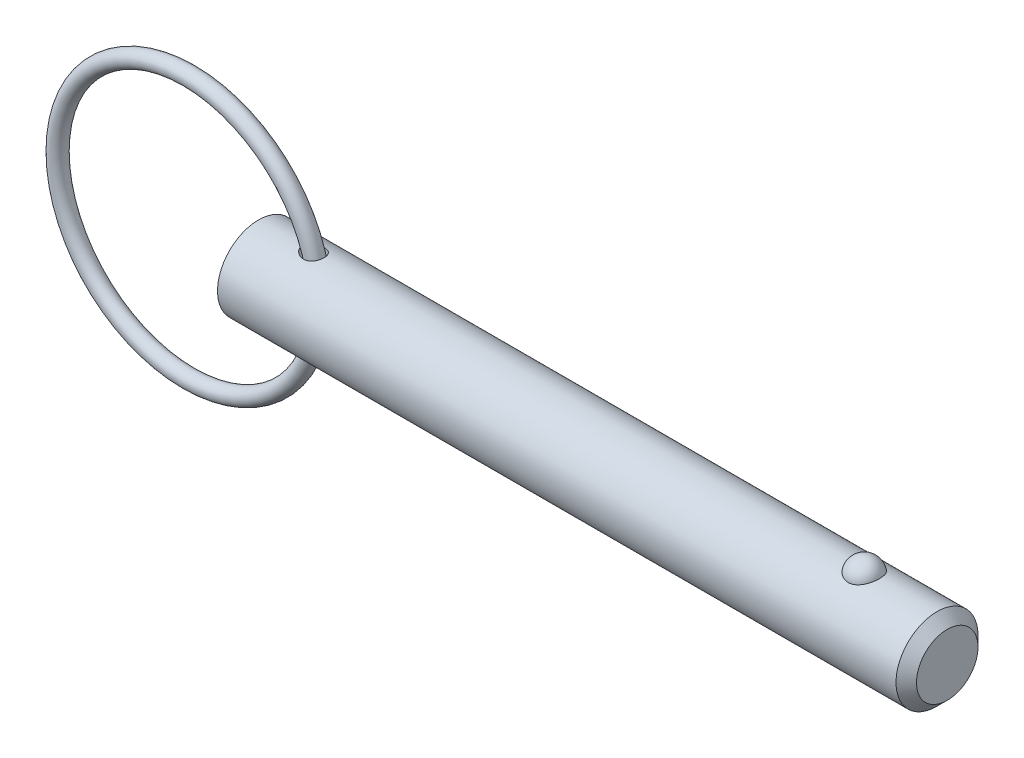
ISO-10303-21;
HEADER;
FILE_DESCRIPTION(('STEP AP214'),'2;1');
FILE_NAME('part.step','',(''),(''),'','','');
FILE_SCHEMA(('AUTOMOTIVE_DESIGN { 1 0 10303 214 1 1 1 1 }'));
ENDSEC;
DATA;
#1=APPLICATION_CONTEXT('core data for automotive mechanical design processes');
#2=APPLICATION_PROTOCOL_DEFINITION('international standard','automotive_design',2000,#1);
#3=PRODUCT_CONTEXT('',#1,'mechanical');
#4=PRODUCT('Part','Part','',(#3));
#5=PRODUCT_RELATED_PRODUCT_CATEGORY('part','',(#4));
#6=PRODUCT_DEFINITION_FORMATION('','',#4);
#7=PRODUCT_DEFINITION_CONTEXT('part definition',#1,'design');
#8=PRODUCT_DEFINITION('design','',#6,#7);
#9=PRODUCT_DEFINITION_SHAPE('','',#8);
#10=(LENGTH_UNIT() NAMED_UNIT(*) SI_UNIT(.MILLI.,.METRE.));
#11=(NAMED_UNIT(*) PLANE_ANGLE_UNIT() SI_UNIT($,.RADIAN.));
#12=(NAMED_UNIT(*) SI_UNIT($,.STERADIAN.) SOLID_ANGLE_UNIT());
#13=UNCERTAINTY_MEASURE_WITH_UNIT(LENGTH_MEASURE(1.E-05),#10,'distance_accuracy_value','');
#14=(GEOMETRIC_REPRESENTATION_CONTEXT(3) GLOBAL_UNCERTAINTY_ASSIGNED_CONTEXT((#13)) GLOBAL_UNIT_ASSIGNED_CONTEXT((#10,
#11,#12)) REPRESENTATION_CONTEXT('',''));
#15=CARTESIAN_POINT('',(0.,0.,0.));
#16=DIRECTION('',(0.,0.,1.));
#17=DIRECTION('',(1.,0.,0.));
#18=AXIS2_PLACEMENT_3D('',#15,#16,#17);
#19=CARTESIAN_POINT('',(-6.75433730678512,0.,0.));
#20=DIRECTION('',(0.,0.,1.));
#21=DIRECTION('',(1.,0.,0.));
#22=AXIS2_PLACEMENT_3D('',#19,#20,#21);
#23=TOROIDAL_SURFACE('',#22,12.7,0.794);
#24=CARTESIAN_POINT('',(6.73966269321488,0.,0.));
#25=VERTEX_POINT('',#24);
#26=VERTEX_LOOP('',#25);
#27=FACE_BOUND('',#26,.T.);
#28=ADVANCED_FACE('P0_F12',(#27),#23,.T.);
#29=CLOSED_SHELL('',(#28));
#30=MANIFOLD_SOLID_BREP('P0_B1',#29);
#31=CARTESIAN_POINT('',(0.,0.,0.));
#32=DIRECTION('',(1.,0.,0.));
#33=DIRECTION('',(0.,0.,-1.));
#34=AXIS2_PLACEMENT_3D('',#31,#32,#33);
#35=CYLINDRICAL_SURFACE('',#34,3.97);
#36=CARTESIAN_POINT('',(4.5061340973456,3.92152479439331,-0.618499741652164));
#37=CARTESIAN_POINT('',(4.54853517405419,3.91408351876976,-0.665679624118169));
#38=CARTESIAN_POINT('',(4.59520918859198,3.90637054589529,-0.709047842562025));
#39=CARTESIAN_POINT('',(4.69529850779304,3.89134328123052,-0.787367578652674));
#40=CARTESIAN_POINT('',(4.74872860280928,3.88402991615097,-0.822300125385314));
#41=CARTESIAN_POINT('',(4.86059505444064,3.87069188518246,-0.882953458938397));
#42=CARTESIAN_POINT('',(4.91902090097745,3.86466460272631,-0.908693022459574));
#43=CARTESIAN_POINT('',(5.03942053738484,3.85463812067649,-0.950329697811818));
#44=CARTESIAN_POINT('',(5.10139227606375,3.85063776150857,-0.966232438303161));
#45=CARTESIAN_POINT('',(5.22799334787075,3.84521819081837,-0.987584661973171));
#46=CARTESIAN_POINT('',(5.29264515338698,3.84382942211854,-0.992910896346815));
#47=CARTESIAN_POINT('',(5.42187784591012,3.84405510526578,-0.992040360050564));
#48=CARTESIAN_POINT('',(5.48645875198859,3.84566813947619,-0.985849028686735));
#49=CARTESIAN_POINT('',(5.60832575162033,3.85155853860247,-0.96256141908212));
#50=CARTESIAN_POINT('',(5.66579014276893,3.85562063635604,-0.946343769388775));
#51=CARTESIAN_POINT('',(5.77675338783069,3.86576598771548,-0.904004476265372));
#52=CARTESIAN_POINT('',(5.83025379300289,3.87184844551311,-0.877886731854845));
#53=CARTESIAN_POINT('',(5.92811265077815,3.88482601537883,-0.818464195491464));
#54=CARTESIAN_POINT('',(5.97284196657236,3.89164057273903,-0.785750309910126));
#55=CARTESIAN_POINT('',(6.05599619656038,3.90559314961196,-0.713164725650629));
#56=CARTESIAN_POINT('',(6.09442162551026,3.91273114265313,-0.673293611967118));
#57=CARTESIAN_POINT('',(6.16349552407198,3.92643411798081,-0.588089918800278));
#58=CARTESIAN_POINT('',(6.19423746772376,3.93300527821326,-0.542833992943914));
#59=CARTESIAN_POINT('',(6.24784048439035,3.94496273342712,-0.447731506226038));
#60=CARTESIAN_POINT('',(6.27070130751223,3.95034899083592,-0.3978847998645));
#61=CARTESIAN_POINT('',(6.30819009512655,3.95940331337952,-0.294515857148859));
#62=CARTESIAN_POINT('',(6.32274046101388,3.96305513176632,-0.240964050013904));
#63=CARTESIAN_POINT('',(6.34295490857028,3.96817541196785,-0.132107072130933));
#64=CARTESIAN_POINT('',(6.34861870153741,3.96964380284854,-0.0768018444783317));
#65=CARTESIAN_POINT('',(6.35094049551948,3.97024250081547,0.0343098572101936));
#66=CARTESIAN_POINT('',(6.34754972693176,3.96936014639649,0.0901174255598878));
#67=CARTESIAN_POINT('',(6.33173352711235,3.9653248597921,0.200354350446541));
#68=CARTESIAN_POINT('',(6.31930791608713,3.96217188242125,0.254783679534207));
#69=CARTESIAN_POINT('',(6.28569545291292,3.95393415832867,0.360736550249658));
#70=CARTESIAN_POINT('',(6.26450524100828,3.94884867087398,0.412258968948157));
#71=CARTESIAN_POINT('',(6.21385621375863,3.93730247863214,0.510898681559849));
#72=CARTESIAN_POINT('',(6.1843975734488,3.93084180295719,0.558016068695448));
#73=CARTESIAN_POINT('',(6.11807283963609,3.91729312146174,0.646300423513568));
#74=CARTESIAN_POINT('',(6.08123803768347,3.91020783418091,0.687491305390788));
#75=CARTESIAN_POINT('',(6.00105036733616,3.89618447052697,0.762970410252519));
#76=CARTESIAN_POINT('',(5.95769831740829,3.88924637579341,0.797259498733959));
#77=CARTESIAN_POINT('',(5.86613530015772,3.87636375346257,0.857702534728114));
#78=CARTESIAN_POINT('',(5.81797537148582,3.87041026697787,0.883931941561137));
#79=CARTESIAN_POINT('',(5.71784316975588,3.86006042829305,0.928089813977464));
#80=CARTESIAN_POINT('',(5.66587104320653,3.85566401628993,0.946018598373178));
#81=CARTESIAN_POINT('',(5.55935910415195,3.84884784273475,0.973381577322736));
#82=CARTESIAN_POINT('',(5.5048082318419,3.84643760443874,0.982774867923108));
#83=CARTESIAN_POINT('',(5.39486598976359,3.84381055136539,0.992999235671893));
#84=CARTESIAN_POINT('',(5.33947443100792,3.84359423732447,0.993828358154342));
#85=CARTESIAN_POINT('',(5.22648231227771,3.84533176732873,0.987084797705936));
#86=CARTESIAN_POINT('',(5.16890896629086,3.84739412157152,0.979092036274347));
#87=CARTESIAN_POINT('',(5.05572652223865,3.85355237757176,0.954563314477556));
#88=CARTESIAN_POINT('',(5.00011821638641,3.85764908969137,0.938023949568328));
#89=CARTESIAN_POINT('',(4.88760177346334,3.86780726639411,0.895259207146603));
#90=CARTESIAN_POINT('',(4.83096658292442,3.87400321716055,0.868345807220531));
#91=CARTESIAN_POINT('',(4.72283286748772,3.88749324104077,0.805802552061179));
#92=CARTESIAN_POINT('',(4.67133743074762,3.89478796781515,0.770167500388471));
#93=CARTESIAN_POINT('',(4.57320957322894,3.90992457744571,0.68930647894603));
#94=CARTESIAN_POINT('',(4.52683185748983,3.91777672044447,0.643771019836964));
#95=CARTESIAN_POINT('',(4.44324307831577,3.93275681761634,0.544809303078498));
#96=CARTESIAN_POINT('',(4.40602610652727,3.939885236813,0.491388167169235));
#97=CARTESIAN_POINT('',(4.34571986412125,3.95183347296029,0.382912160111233));
#98=CARTESIAN_POINT('',(4.32168268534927,3.95680025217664,0.328404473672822));
#99=CARTESIAN_POINT('',(4.28478280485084,3.96454157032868,0.215602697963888));
#100=CARTESIAN_POINT('',(4.27190231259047,3.96731959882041,0.157314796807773));
#101=CARTESIAN_POINT('',(4.25937356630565,3.97002560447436,0.0481762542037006));
#102=CARTESIAN_POINT('',(4.25802727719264,3.97031923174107,-0.0024752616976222));
#103=CARTESIAN_POINT('',(4.26422295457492,3.96897737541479,-0.103210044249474));
#104=CARTESIAN_POINT('',(4.27176468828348,3.96734194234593,-0.153293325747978));
#105=CARTESIAN_POINT('',(4.29457390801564,3.96248430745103,-0.248530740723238));
#106=CARTESIAN_POINT('',(4.30937736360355,3.95935769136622,-0.29380319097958));
#107=CARTESIAN_POINT('',(4.34569993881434,3.95187968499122,-0.381417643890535));
#108=CARTESIAN_POINT('',(4.36721517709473,3.94752900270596,-0.42376132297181));
#109=CARTESIAN_POINT('',(4.4082169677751,3.93952317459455,-0.491758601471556));
#110=CARTESIAN_POINT('',(4.42613511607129,3.93609353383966,-0.518404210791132));
#111=CARTESIAN_POINT('',(4.46438343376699,3.92897396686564,-0.569857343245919));
#112=CARTESIAN_POINT('',(4.48471350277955,3.92528405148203,-0.594664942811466));
#113=CARTESIAN_POINT('',(4.5061340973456,3.92152479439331,-0.618499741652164));
#114=B_SPLINE_CURVE_WITH_KNOTS('',3,(#36,#37,#38,#39,#40,#41,#42,#43,#44,#45,#46,#47,#48,#49,
#50,#51,#52,#53,#54,#55,#56,#57,#58,#59,#60,#61,#62,#63,#64,#65,#66,#67,#68,#69,#70,#71,#72,#73,
#74,#75,#76,#77,#78,#79,#80,#81,#82,#83,#84,#85,#86,#87,#88,#89,#90,#91,#92,#93,#94,#95,#96,#97,
#98,#99,#100,#101,#102,#103,#104,#105,#106,#107,#108,#109,#110,#111,#112,#113),.UNSPECIFIED.,
.T.,.F.,(4,2,2,2,2,2,2,2,2,2,2,2,2,2,2,2,2,2,2,2,2,2,2,2,2,2,2,2,2,2,2,2,2,2,2,2,2,2,4),(0.,
0.191481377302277,0.383389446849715,0.574903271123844,0.76630740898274,0.959929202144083,
1.15345957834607,1.33205157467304,1.51057330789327,1.67726576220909,1.84394459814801,
2.00848443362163,2.17302948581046,2.33908685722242,2.50514962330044,2.6721086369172,
2.83907097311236,3.00609737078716,3.17312023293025,3.33944900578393,3.5057569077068,
3.67045663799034,3.83515004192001,4.00062859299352,4.16614491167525,4.33989638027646,
4.51371711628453,4.70191549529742,4.89022627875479,5.08559712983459,5.28084164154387,
5.45908728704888,5.63704817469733,5.78825771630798,5.93946329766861,6.08206496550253,
6.22458432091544,6.32132279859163,6.41805725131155),.UNSPECIFIED.);
#115=CARTESIAN_POINT('',(4.5061340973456,3.92152479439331,-0.618499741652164));
#116=VERTEX_POINT('',#115);
#117=EDGE_CURVE('P1_E40',#116,#116,#114,.T.);
#118=ORIENTED_EDGE('',*,*,#117,.T.);
#119=EDGE_LOOP('',(#118));
#120=FACE_BOUND('',#119,.T.);
#121=CARTESIAN_POINT('',(65.6875,0.,0.));
#122=DIRECTION('',(1.,0.,0.));
#123=DIRECTION('',(0.,0.,-1.));
#124=AXIS2_PLACEMENT_3D('',#121,#122,#123);
#125=CIRCLE('',#124,3.97);
#126=CARTESIAN_POINT('',(65.6875,0.,-3.97));
#127=VERTEX_POINT('',#126);
#128=EDGE_CURVE('P1_E25',#127,#127,#125,.T.);
#129=ORIENTED_EDGE('',*,*,#128,.F.);
#130=EDGE_LOOP('',(#129));
#131=FACE_BOUND('',#130,.T.);
#132=CARTESIAN_POINT('',(0.,0.,0.));
#133=DIRECTION('',(1.,0.,0.));
#134=DIRECTION('',(0.,0.,-1.));
#135=AXIS2_PLACEMENT_3D('',#132,#133,#134);
#136=CIRCLE('',#135,3.97);
#137=CARTESIAN_POINT('',(0.,0.,-3.97));
#138=VERTEX_POINT('',#137);
#139=EDGE_CURVE('P1_E9',#138,#138,#136,.T.);
#140=ORIENTED_EDGE('',*,*,#139,.T.);
#141=EDGE_LOOP('',(#140));
#142=FACE_BOUND('',#141,.T.);
#143=CARTESIAN_POINT('',(58.6451922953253,3.65715365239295,1.54470941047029));
#144=CARTESIAN_POINT('',(58.5652448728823,3.65716001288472,1.5447029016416));
#145=CARTESIAN_POINT('',(58.4851650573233,3.65987074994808,1.53832549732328));
#146=CARTESIAN_POINT('',(58.3272374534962,3.6704221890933,1.51297018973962));
#147=CARTESIAN_POINT('',(58.2493961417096,3.67827646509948,1.49395894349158));
#148=CARTESIAN_POINT('',(58.0984614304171,3.69818848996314,1.44395950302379));
#149=CARTESIAN_POINT('',(58.0253560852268,3.71023513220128,1.41300293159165));
#150=CARTESIAN_POINT('',(57.8855630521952,3.7372183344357,1.34000212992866));
#151=CARTESIAN_POINT('',(57.8188725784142,3.75215363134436,1.29796274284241));
#152=CARTESIAN_POINT('',(57.69148864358,3.78384968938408,1.20248834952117));
#153=CARTESIAN_POINT('',(57.6310299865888,3.80065129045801,1.14875388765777));
#154=CARTESIAN_POINT('',(57.5196942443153,3.83398532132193,1.03205417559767));
#155=CARTESIAN_POINT('',(57.4688200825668,3.85051766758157,0.969086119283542));
#156=CARTESIAN_POINT('',(57.3756321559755,3.88238608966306,0.832526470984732));
#157=CARTESIAN_POINT('',(57.3337961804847,3.89763698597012,0.758588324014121));
#158=CARTESIAN_POINT('',(57.2625108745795,3.92451063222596,0.604352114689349));
#159=CARTESIAN_POINT('',(57.2330623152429,3.93613315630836,0.524053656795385));
#160=CARTESIAN_POINT('',(57.1868927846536,3.95467606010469,0.35840348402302));
#161=CARTESIAN_POINT('',(57.1703127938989,3.96154426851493,0.273006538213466));
#162=CARTESIAN_POINT('',(57.150756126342,3.96967008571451,0.100408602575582));
#163=CARTESIAN_POINT('',(57.1477789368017,3.97092790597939,0.013207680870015));
#164=CARTESIAN_POINT('',(57.1554587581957,3.96771794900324,-0.159844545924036));
#165=CARTESIAN_POINT('',(57.1660164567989,3.96329187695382,-0.245701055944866));
#166=CARTESIAN_POINT('',(57.2003800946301,3.94923163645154,-0.414277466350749));
#167=CARTESIAN_POINT('',(57.2241862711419,3.93959737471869,-0.496997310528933));
#168=CARTESIAN_POINT('',(57.2846114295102,3.91607752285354,-0.65711357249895));
#169=CARTESIAN_POINT('',(57.3212495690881,3.90218558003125,-0.734501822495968));
#170=CARTESIAN_POINT('',(57.4065935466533,3.87158287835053,-0.881704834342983));
#171=CARTESIAN_POINT('',(57.4553004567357,3.8548718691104,-0.951518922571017));
#172=CARTESIAN_POINT('',(57.5641161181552,3.82028735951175,-1.08208159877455));
#173=CARTESIAN_POINT('',(57.6242955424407,3.80240713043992,-1.14276958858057));
#174=CARTESIAN_POINT('',(57.754493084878,3.76758161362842,-1.25282437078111));
#175=CARTESIAN_POINT('',(57.8245105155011,3.75063626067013,-1.30219195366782));
#176=CARTESIAN_POINT('',(57.97118160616,3.71998948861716,-1.38729709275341));
#177=CARTESIAN_POINT('',(58.0476813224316,3.70623183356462,-1.42327904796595));
#178=CARTESIAN_POINT('',(58.2062981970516,3.68323188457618,-1.48178996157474));
#179=CARTESIAN_POINT('',(58.2884132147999,3.67398788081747,-1.50432401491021));
#180=CARTESIAN_POINT('',(58.4514810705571,3.6615216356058,-1.53440939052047));
#181=CARTESIAN_POINT('',(58.5322840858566,3.65801951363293,-1.54265826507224));
#182=CARTESIAN_POINT('',(58.6942085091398,3.65657341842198,-1.5460842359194));
#183=CARTESIAN_POINT('',(58.7753298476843,3.65862829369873,-1.54126404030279));
#184=CARTESIAN_POINT('',(58.9328122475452,3.66788969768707,-1.51908474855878));
#185=CARTESIAN_POINT('',(59.0092422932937,3.67492621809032,-1.50213925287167));
#186=CARTESIAN_POINT('',(59.1580412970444,3.69318404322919,-1.45666982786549));
#187=CARTESIAN_POINT('',(59.2304099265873,3.70440568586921,-1.42814496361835));
#188=CARTESIAN_POINT('',(59.3708029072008,3.73012749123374,-1.35956319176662));
#189=CARTESIAN_POINT('',(59.4387000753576,3.74469307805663,-1.31927107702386));
#190=CARTESIAN_POINT('',(59.5668649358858,3.77545272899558,-1.22847440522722));
#191=CARTESIAN_POINT('',(59.6271308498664,3.79164717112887,-1.17796747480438));
#192=CARTESIAN_POINT('',(59.7416346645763,3.82490325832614,-1.06519260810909));
#193=CARTESIAN_POINT('',(59.7954137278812,3.84196735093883,-1.00245914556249));
#194=CARTESIAN_POINT('',(59.8920988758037,3.87439863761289,-0.868715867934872));
#195=CARTESIAN_POINT('',(59.9350030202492,3.88976552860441,-0.797704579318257));
#196=CARTESIAN_POINT('',(60.010266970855,3.91771381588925,-0.646896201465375));
#197=CARTESIAN_POINT('',(60.0422532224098,3.93019255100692,-0.566893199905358));
#198=CARTESIAN_POINT('',(60.0931101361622,3.95043886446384,-0.402255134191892));
#199=CARTESIAN_POINT('',(60.1119807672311,3.95820643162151,-0.317620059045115));
#200=CARTESIAN_POINT('',(60.1362162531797,3.96823733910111,-0.146156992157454));
#201=CARTESIAN_POINT('',(60.1415874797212,3.970503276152,-0.0593300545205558));
#202=CARTESIAN_POINT('',(60.138730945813,3.96930811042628,0.11405797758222));
#203=CARTESIAN_POINT('',(60.1305035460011,3.9658471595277,0.200619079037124));
#204=CARTESIAN_POINT('',(60.1007063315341,3.95358562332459,0.370506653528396));
#205=CARTESIAN_POINT('',(60.0792129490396,3.94481563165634,0.453848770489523));
#206=CARTESIAN_POINT('',(60.0233839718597,3.92284586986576,0.615497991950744));
#207=CARTESIAN_POINT('',(59.9890474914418,3.90964579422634,0.693804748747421));
#208=CARTESIAN_POINT('',(59.9079702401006,3.88006987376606,0.843703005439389));
#209=CARTESIAN_POINT('',(59.8611536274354,3.86367478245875,0.915249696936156));
#210=CARTESIAN_POINT('',(59.7561897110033,3.82949741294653,1.04910810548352));
#211=CARTESIAN_POINT('',(59.6980428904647,3.81171519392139,1.1114202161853));
#212=CARTESIAN_POINT('',(59.5717433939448,3.77673366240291,1.22503948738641));
#213=CARTESIAN_POINT('',(59.5035970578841,3.75953398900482,1.27635357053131));
#214=CARTESIAN_POINT('',(59.3589009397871,3.72770506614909,1.36653336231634));
#215=CARTESIAN_POINT('',(59.282348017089,3.71307678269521,1.40539439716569));
#216=CARTESIAN_POINT('',(59.1257594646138,3.68864287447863,1.46830480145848));
#217=CARTESIAN_POINT('',(59.0459307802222,3.67869017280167,1.49281289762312));
#218=CARTESIAN_POINT('',(58.8829877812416,3.66414535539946,1.52817474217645));
#219=CARTESIAN_POINT('',(58.7998840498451,3.65953723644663,1.53906926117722));
#220=CARTESIAN_POINT('',(58.6927760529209,3.6573894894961,1.54414878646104));
#221=CARTESIAN_POINT('',(58.6689900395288,3.65715175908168,1.54471134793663));
#222=CARTESIAN_POINT('',(58.6451922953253,3.65715365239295,1.54470941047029));
#223=B_SPLINE_CURVE_WITH_KNOTS('',3,(#143,#144,#145,#146,#147,#148,#149,#150,#151,#152,#153,
#154,#155,#156,#157,#158,#159,#160,#161,#162,#163,#164,#165,#166,#167,#168,#169,#170,#171,#172,
#173,#174,#175,#176,#177,#178,#179,#180,#181,#182,#183,#184,#185,#186,#187,#188,#189,#190,#191,
#192,#193,#194,#195,#196,#197,#198,#199,#200,#201,#202,#203,#204,#205,#206,#207,#208,#209,#210,
#211,#212,#213,#214,#215,#216,#217,#218,#219,#220,#221,#222),.UNSPECIFIED.,.T.,.F.,(4,2,2,2,2,2,
2,2,2,2,2,2,2,2,2,2,2,2,2,2,2,2,2,2,2,2,2,2,2,2,2,2,2,2,2,2,2,2,2,4),(0.,0.239777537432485,
0.480190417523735,0.71997117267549,0.959647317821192,1.20639040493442,1.45320863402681,
1.71093679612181,1.96868099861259,2.2292105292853,2.48973023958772,2.74834928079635,
3.00697295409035,3.26598440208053,3.52501886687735,3.78570385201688,4.04637062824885,
4.3020125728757,4.55755760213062,4.80022994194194,5.0428520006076,5.27757006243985,
5.5123070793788,5.75210128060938,5.99195126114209,6.24392810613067,6.49594987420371,
6.75588818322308,7.01582710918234,7.2756433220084,7.53545264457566,7.79377886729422,
8.05212290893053,8.31207418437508,8.5720143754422,8.83179046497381,9.09166393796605,
9.34270057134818,9.5929835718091,9.66435753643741),.UNSPECIFIED.);
#224=CARTESIAN_POINT('',(58.6451922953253,3.65715365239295,1.54470941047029));
#225=VERTEX_POINT('',#224);
#226=EDGE_CURVE('P1_E34',#225,#225,#223,.T.);
#227=ORIENTED_EDGE('',*,*,#226,.T.);
#228=EDGE_LOOP('',(#227));
#229=FACE_BOUND('',#228,.T.);
#230=CARTESIAN_POINT('',(4.5061340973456,-3.92152479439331,-0.618499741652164));
#231=CARTESIAN_POINT('',(4.47063221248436,-3.92775524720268,-0.57899519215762));
#232=CARTESIAN_POINT('',(4.43810149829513,-3.93379908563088,-0.536794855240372));
#233=CARTESIAN_POINT('',(4.38017497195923,-3.94493883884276,-0.447628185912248));
#234=CARTESIAN_POINT('',(4.35477467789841,-3.95003534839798,-0.400664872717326));
#235=CARTESIAN_POINT('',(4.31221789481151,-3.95875465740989,-0.302642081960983));
#236=CARTESIAN_POINT('',(4.29511088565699,-3.96236859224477,-0.251560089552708));
#237=CARTESIAN_POINT('',(4.27046538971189,-3.96762012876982,-0.14703606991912));
#238=CARTESIAN_POINT('',(4.26292104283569,-3.96925894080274,-0.0935955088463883));
#239=CARTESIAN_POINT('',(4.25814817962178,-3.97029345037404,0.00916757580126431));
#240=CARTESIAN_POINT('',(4.26009234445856,-3.96986905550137,0.0584512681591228));
#241=CARTESIAN_POINT('',(4.2722946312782,-3.96723648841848,0.15592126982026));
#242=CARTESIAN_POINT('',(4.28255257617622,-3.96502835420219,0.204107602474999));
#243=CARTESIAN_POINT('',(4.3104038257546,-3.95915538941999,0.296804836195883));
#244=CARTESIAN_POINT('',(4.32779766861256,-3.95553028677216,0.341378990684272));
#245=CARTESIAN_POINT('',(4.36906896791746,-3.94717481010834,0.427290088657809));
#246=CARTESIAN_POINT('',(4.39294824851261,-3.94244412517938,0.468626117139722));
#247=CARTESIAN_POINT('',(4.44891306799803,-3.93178155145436,0.551268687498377));
#248=CARTESIAN_POINT('',(4.48157347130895,-3.92577737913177,0.592175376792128));
#249=CARTESIAN_POINT('',(4.55251112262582,-3.91346489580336,0.668729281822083));
#250=CARTESIAN_POINT('',(4.59079150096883,-3.90715641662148,0.704373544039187));
#251=CARTESIAN_POINT('',(4.67775521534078,-3.89387548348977,0.774654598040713));
#252=CARTESIAN_POINT('',(4.72714377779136,-3.88693620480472,0.808427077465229));
#253=CARTESIAN_POINT('',(4.83064277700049,-3.8740635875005,0.868022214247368));
#254=CARTESIAN_POINT('',(4.88475591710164,-3.86813083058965,0.893840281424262));
#255=CARTESIAN_POINT('',(5.00110106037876,-3.85749476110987,0.938729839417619));
#256=CARTESIAN_POINT('',(5.06363405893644,-3.85293457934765,0.957062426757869));
#257=CARTESIAN_POINT('',(5.19104406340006,-3.84642688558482,0.98289453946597));
#258=CARTESIAN_POINT('',(5.25592057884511,-3.84447883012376,0.990396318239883));
#259=CARTESIAN_POINT('',(5.38389367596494,-3.84360582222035,0.993779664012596));
#260=CARTESIAN_POINT('',(5.44697893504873,-3.84458391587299,0.990033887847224));
#261=CARTESIAN_POINT('',(5.57135239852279,-3.84935403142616,0.971322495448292));
#262=CARTESIAN_POINT('',(5.63264168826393,-3.85314431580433,0.956363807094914));
#263=CARTESIAN_POINT('',(5.74616757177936,-3.86267246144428,0.917075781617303));
#264=CARTESIAN_POINT('',(5.79873169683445,-3.86821908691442,0.893643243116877));
#265=CARTESIAN_POINT('',(5.89880370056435,-3.88065529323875,0.837987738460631));
#266=CARTESIAN_POINT('',(5.94631268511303,-3.88754457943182,0.805766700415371));
#267=CARTESIAN_POINT('',(6.03285109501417,-3.90151699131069,0.735052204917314));
#268=CARTESIAN_POINT('',(6.07216200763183,-3.90857818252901,0.696897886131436));
#269=CARTESIAN_POINT('',(6.14379115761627,-3.92238187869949,0.614461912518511));
#270=CARTESIAN_POINT('',(6.17610956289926,-3.92912439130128,0.570180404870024));
#271=CARTESIAN_POINT('',(6.23298117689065,-3.94155789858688,0.476700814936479));
#272=CARTESIAN_POINT('',(6.25752764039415,-3.94724797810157,0.427498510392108));
#273=CARTESIAN_POINT('',(6.29825018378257,-3.95695712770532,0.325589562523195));
#274=CARTESIAN_POINT('',(6.31442591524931,-3.96097612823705,0.272882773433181));
#275=CARTESIAN_POINT('',(6.33815165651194,-3.96694319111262,0.164947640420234));
#276=CARTESIAN_POINT('',(6.34562253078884,-3.96887224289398,0.109700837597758));
#277=CARTESIAN_POINT('',(6.35150690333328,-3.97038782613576,-0.00130546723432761));
#278=CARTESIAN_POINT('',(6.34992017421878,-3.96997429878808,-0.0570649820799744));
#279=CARTESIAN_POINT('',(6.33770614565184,-3.96684417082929,-0.167685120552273));
#280=CARTESIAN_POINT('',(6.32705245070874,-3.96412084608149,-0.222542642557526));
#281=CARTESIAN_POINT('',(6.29690849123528,-3.95665587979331,-0.329631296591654));
#282=CARTESIAN_POINT('',(6.27741810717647,-3.95191421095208,-0.381862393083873));
#283=CARTESIAN_POINT('',(6.23007557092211,-3.94093577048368,-0.482151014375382));
#284=CARTESIAN_POINT('',(6.20223216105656,-3.93470056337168,-0.530212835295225));
#285=CARTESIAN_POINT('',(6.13885089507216,-3.92142345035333,-0.620836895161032));
#286=CARTESIAN_POINT('',(6.10331353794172,-3.9143815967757,-0.663399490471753));
#287=CARTESIAN_POINT('',(6.02573506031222,-3.90033441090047,-0.741525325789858));
#288=CARTESIAN_POINT('',(5.9837408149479,-3.89332916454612,-0.777135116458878));
#289=CARTESIAN_POINT('',(5.89422937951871,-3.88009391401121,-0.840731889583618));
#290=CARTESIAN_POINT('',(5.84671289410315,-3.87386381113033,-0.868719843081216));
#291=CARTESIAN_POINT('',(5.74792005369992,-3.86290904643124,-0.916201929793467));
#292=CARTESIAN_POINT('',(5.69667597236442,-3.85817300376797,-0.935760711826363));
#293=CARTESIAN_POINT('',(5.59158164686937,-3.85061943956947,-0.966374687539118));
#294=CARTESIAN_POINT('',(5.53773121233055,-3.84780205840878,-0.97742925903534));
#295=CARTESIAN_POINT('',(5.42780663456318,-3.844282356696,-0.991183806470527));
#296=CARTESIAN_POINT('',(5.37170954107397,-3.84362414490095,-0.993709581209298));
#297=CARTESIAN_POINT('',(5.2598091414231,-3.84452352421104,-0.990222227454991));
#298=CARTESIAN_POINT('',(5.20400591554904,-3.84608169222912,-0.984206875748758));
#299=CARTESIAN_POINT('',(5.09021941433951,-3.85134557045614,-0.963410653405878));
#300=CARTESIAN_POINT('',(5.03234703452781,-3.85519050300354,-0.948059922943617));
#301=CARTESIAN_POINT('',(4.91972924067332,-3.86464451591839,-0.908751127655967));
#302=CARTESIAN_POINT('',(4.86498619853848,-3.87025491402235,-0.884786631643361));
#303=CARTESIAN_POINT('',(4.75497621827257,-3.88320265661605,-0.826208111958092));
#304=CARTESIAN_POINT('',(4.70013922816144,-3.89065244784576,-0.790807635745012));
#305=CARTESIAN_POINT('',(4.59743373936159,-3.90600301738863,-0.711112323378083));
#306=CARTESIAN_POINT('',(4.54956105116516,-3.91390352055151,-0.666822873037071));
#307=CARTESIAN_POINT('',(4.5061340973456,-3.92152479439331,-0.618499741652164));
#308=B_SPLINE_CURVE_WITH_KNOTS('',3,(#230,#231,#232,#233,#234,#235,#236,#237,#238,#239,#240,
#241,#242,#243,#244,#245,#246,#247,#248,#249,#250,#251,#252,#253,#254,#255,#256,#257,#258,#259,
#260,#261,#262,#263,#264,#265,#266,#267,#268,#269,#270,#271,#272,#273,#274,#275,#276,#277,#278,
#279,#280,#281,#282,#283,#284,#285,#286,#287,#288,#289,#290,#291,#292,#293,#294,#295,#296,#297,
#298,#299,#300,#301,#302,#303,#304,#305,#306,#307),.UNSPECIFIED.,.T.,.F.,(4,2,2,2,2,2,2,2,2,2,2,
2,2,2,2,2,2,2,2,2,2,2,2,2,2,2,2,2,2,2,2,2,2,2,2,2,2,2,4),(0.,0.160252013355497,
0.320403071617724,0.481498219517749,0.642494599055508,0.789717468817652,0.936937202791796,
1.08029540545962,1.22369397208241,1.38114509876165,1.53868426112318,1.7186296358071,
1.89867865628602,2.09368931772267,2.28865940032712,2.47724174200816,2.66570766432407,
2.83827720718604,3.01080892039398,3.17573461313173,3.34065634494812,3.50572082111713,
3.67079216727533,3.83735274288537,4.00391749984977,4.17096882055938,4.33802240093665,
4.50490174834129,4.6717702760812,4.83748008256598,5.0031687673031,5.16756302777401,
5.3319693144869,5.49971393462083,5.66750222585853,5.84673431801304,6.02610050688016,
6.22224398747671,6.41826898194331),.UNSPECIFIED.);
#309=CARTESIAN_POINT('',(4.5061340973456,-3.92152479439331,-0.618499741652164));
#310=VERTEX_POINT('',#309);
#311=EDGE_CURVE('P1_E17',#310,#310,#308,.T.);
#312=ORIENTED_EDGE('',*,*,#311,.T.);
#313=EDGE_LOOP('',(#312));
#314=FACE_BOUND('',#313,.T.);
#315=ADVANCED_FACE('P1_F13',(#120,#131,#142,#229,#314),#35,.T.);
#316=CARTESIAN_POINT('',(0.,0.,0.));
#317=DIRECTION('',(-1.,0.,0.));
#318=DIRECTION('',(0.,0.,1.));
#319=AXIS2_PLACEMENT_3D('',#316,#317,#318);
#320=PLANE('',#319);
#321=ORIENTED_EDGE('',*,*,#139,.F.);
#322=EDGE_LOOP('',(#321));
#323=FACE_BOUND('',#322,.T.);
#324=ADVANCED_FACE('P1_F15',(#323),#320,.T.);
#325=CARTESIAN_POINT('',(66.68,0.,0.));
#326=DIRECTION('',(-1.,0.,0.));
#327=DIRECTION('',(0.,0.,1.));
#328=AXIS2_PLACEMENT_3D('',#325,#326,#327);
#329=CONICAL_SURFACE('',#328,2.97750000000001,0.785398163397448);
#330=ORIENTED_EDGE('',*,*,#128,.T.);
#331=EDGE_LOOP('',(#330));
#332=FACE_BOUND('',#331,.T.);
#333=CARTESIAN_POINT('',(66.68,0.,0.));
#334=DIRECTION('',(1.,0.,0.));
#335=DIRECTION('',(0.,0.,-1.));
#336=AXIS2_PLACEMENT_3D('',#333,#334,#335);
#337=CIRCLE('',#336,2.97750000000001);
#338=CARTESIAN_POINT('',(66.68,0.,-2.97750000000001));
#339=VERTEX_POINT('',#338);
#340=EDGE_CURVE('P1_E30',#339,#339,#337,.T.);
#341=ORIENTED_EDGE('',*,*,#340,.F.);
#342=EDGE_LOOP('',(#341));
#343=FACE_BOUND('',#342,.T.);
#344=ADVANCED_FACE('P1_F55',(#332,#343),#329,.T.);
#345=CARTESIAN_POINT('',(66.68,2.97750000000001,0.));
#346=DIRECTION('',(1.,0.,0.));
#347=DIRECTION('',(0.,0.,-1.));
#348=AXIS2_PLACEMENT_3D('',#345,#346,#347);
#349=PLANE('',#348);
#350=ORIENTED_EDGE('',*,*,#340,.T.);
#351=EDGE_LOOP('',(#350));
#352=FACE_BOUND('',#351,.T.);
#353=ADVANCED_FACE('P1_F51',(#352),#349,.T.);
#354=CARTESIAN_POINT('',(58.6451922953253,3.573,0.));
#355=DIRECTION('',(-1.,0.,0.));
#356=DIRECTION('',(0.,1.,0.));
#357=AXIS2_PLACEMENT_3D('',#354,#355,#356);
#358=SPHERICAL_SURFACE('',#357,1.547);
#359=ORIENTED_EDGE('',*,*,#226,.F.);
#360=EDGE_LOOP('',(#359));
#361=FACE_BOUND('',#360,.T.);
#362=ADVANCED_FACE('P1_F46',(#361),#358,.T.);
#363=CARTESIAN_POINT('',(-6.75433730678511,0.,0.));
#364=DIRECTION('',(0.,0.,1.));
#365=DIRECTION('',(1.,0.,0.));
#366=AXIS2_PLACEMENT_3D('',#363,#364,#365);
#367=TOROIDAL_SURFACE('',#366,12.7,0.9925);
#368=ORIENTED_EDGE('',*,*,#311,.F.);
#369=EDGE_LOOP('',(#368));
#370=FACE_BOUND('',#369,.T.);
#371=ORIENTED_EDGE('',*,*,#117,.F.);
#372=EDGE_LOOP('',(#371));
#373=FACE_BOUND('',#372,.T.);
#374=ADVANCED_FACE('P1_F50',(#370,#373),#367,.F.);
#375=CLOSED_SHELL('',(#315,#324,#344,#353,#362,#374));
#376=MANIFOLD_SOLID_BREP('P1_B1',#375);
#377=ADVANCED_BREP_SHAPE_REPRESENTATION('',(#18,#30,#376),#14);
#378=SHAPE_DEFINITION_REPRESENTATION(#9,#377);
ENDSEC;
END-ISO-10303-21;
